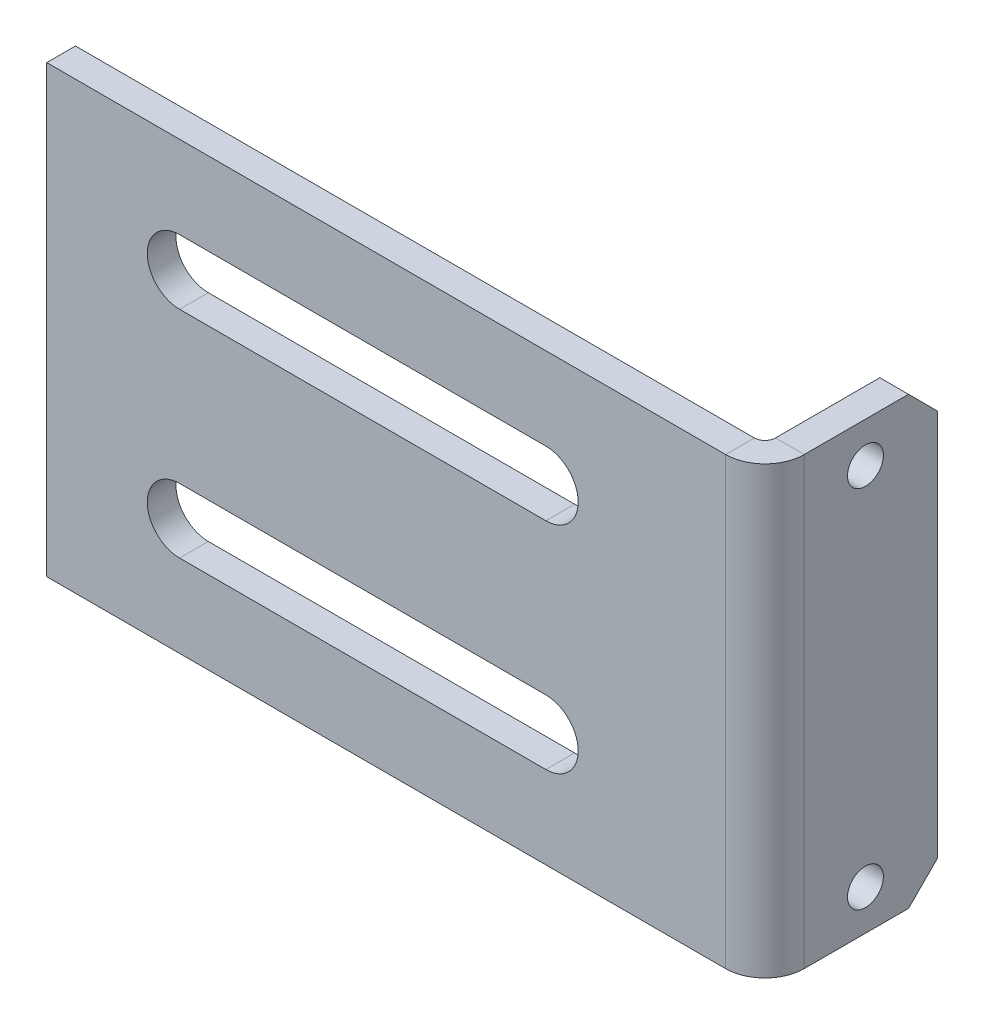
ISO-10303-21;
HEADER;
FILE_DESCRIPTION(('STEP AP214'),'2;1');
FILE_NAME('part.step','',(''),(''),'','','');
FILE_SCHEMA(('AUTOMOTIVE_DESIGN { 1 0 10303 214 1 1 1 1 }'));
ENDSEC;
DATA;
#1=APPLICATION_CONTEXT('core data for automotive mechanical design processes');
#2=APPLICATION_PROTOCOL_DEFINITION('international standard','automotive_design',2000,#1);
#3=PRODUCT_CONTEXT('',#1,'mechanical');
#4=PRODUCT('Part','Part','',(#3));
#5=PRODUCT_RELATED_PRODUCT_CATEGORY('part','',(#4));
#6=PRODUCT_DEFINITION_FORMATION('','',#4);
#7=PRODUCT_DEFINITION_CONTEXT('part definition',#1,'design');
#8=PRODUCT_DEFINITION('design','',#6,#7);
#9=PRODUCT_DEFINITION_SHAPE('','',#8);
#10=(LENGTH_UNIT() NAMED_UNIT(*) SI_UNIT(.MILLI.,.METRE.));
#11=(NAMED_UNIT(*) PLANE_ANGLE_UNIT() SI_UNIT($,.RADIAN.));
#12=(NAMED_UNIT(*) SI_UNIT($,.STERADIAN.) SOLID_ANGLE_UNIT());
#13=UNCERTAINTY_MEASURE_WITH_UNIT(LENGTH_MEASURE(1.E-05),#10,'distance_accuracy_value','');
#14=(GEOMETRIC_REPRESENTATION_CONTEXT(3) GLOBAL_UNCERTAINTY_ASSIGNED_CONTEXT((#13)) GLOBAL_UNIT_ASSIGNED_CONTEXT((#10,
#11,#12)) REPRESENTATION_CONTEXT('',''));
#15=CARTESIAN_POINT('',(0.,0.,0.));
#16=DIRECTION('',(0.,0.,1.));
#17=DIRECTION('',(1.,0.,0.));
#18=AXIS2_PLACEMENT_3D('',#15,#16,#17);
#19=CARTESIAN_POINT('',(0.,-11.4337247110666,-2.));
#20=DIRECTION('',(0.,-1.,0.));
#21=DIRECTION('',(0.,0.,-1.));
#22=AXIS2_PLACEMENT_3D('',#19,#20,#21);
#23=PLANE('',#22);
#24=DIRECTION('',(1.,0.,0.));
#25=VECTOR('',#24,1.);
#26=CARTESIAN_POINT('',(0.,-11.4337247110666,-2.));
#27=LINE('',#26,#25);
#28=CARTESIAN_POINT('',(0.,-11.4337247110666,-2.));
#29=VERTEX_POINT('',#28);
#30=CARTESIAN_POINT('',(47.2634,-11.4337247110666,-2.));
#31=VERTEX_POINT('',#30);
#32=EDGE_CURVE('E266',#29,#31,#27,.T.);
#33=ORIENTED_EDGE('',*,*,#32,.T.);
#34=DIRECTION('',(0.,0.,1.));
#35=VECTOR('',#34,1.);
#36=CARTESIAN_POINT('',(47.2634,-11.4337247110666,-2.));
#37=LINE('',#36,#35);
#38=CARTESIAN_POINT('',(47.2634,-11.4337247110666,0.));
#39=VERTEX_POINT('',#38);
#40=EDGE_CURVE('E247',#31,#39,#37,.T.);
#41=ORIENTED_EDGE('',*,*,#40,.T.);
#42=DIRECTION('',(1.,0.,0.));
#43=VECTOR('',#42,1.);
#44=CARTESIAN_POINT('',(0.,-11.4337247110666,0.));
#45=LINE('',#44,#43);
#46=CARTESIAN_POINT('',(0.,-11.4337247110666,0.));
#47=VERTEX_POINT('',#46);
#48=EDGE_CURVE('E275',#47,#39,#45,.T.);
#49=ORIENTED_EDGE('',*,*,#48,.F.);
#50=DIRECTION('',(0.,0.,1.));
#51=VECTOR('',#50,1.);
#52=CARTESIAN_POINT('',(0.,-11.4337247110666,-2.));
#53=LINE('',#52,#51);
#54=EDGE_CURVE('E272',#29,#47,#53,.T.);
#55=ORIENTED_EDGE('',*,*,#54,.F.);
#56=EDGE_LOOP('',(#33,#41,#49,#55));
#57=FACE_BOUND('',#56,.T.);
#58=ADVANCED_FACE('F16',(#57),#23,.T.);
#59=CARTESIAN_POINT('',(0.,0.,-2.));
#60=DIRECTION('',(0.,0.,-1.));
#61=DIRECTION('',(-1.,0.,0.));
#62=AXIS2_PLACEMENT_3D('',#59,#60,#61);
#63=PLANE('',#62);
#64=CARTESIAN_POINT('',(9.25,-3.43372471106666,-2.));
#65=DIRECTION('',(0.,0.,-1.));
#66=DIRECTION('',(-1.,0.,0.));
#67=AXIS2_PLACEMENT_3D('',#64,#65,#66);
#68=CIRCLE('',#67,2.25);
#69=CARTESIAN_POINT('',(9.25,-5.68372471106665,-2.));
#70=VERTEX_POINT('',#69);
#71=CARTESIAN_POINT('',(9.25,-1.18372471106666,-2.));
#72=VERTEX_POINT('',#71);
#73=EDGE_CURVE('E164',#70,#72,#68,.T.);
#74=ORIENTED_EDGE('',*,*,#73,.F.);
#75=DIRECTION('',(-1.,0.,0.));
#76=VECTOR('',#75,1.);
#77=CARTESIAN_POINT('',(0.,-5.68372471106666,-2.));
#78=LINE('',#77,#76);
#79=CARTESIAN_POINT('',(34.75,-5.68372471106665,-2.));
#80=VERTEX_POINT('',#79);
#81=EDGE_CURVE('E180',#80,#70,#78,.T.);
#82=ORIENTED_EDGE('',*,*,#81,.F.);
#83=CARTESIAN_POINT('',(34.75,-3.43372471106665,-2.));
#84=DIRECTION('',(0.,0.,-1.));
#85=DIRECTION('',(-1.,0.,0.));
#86=AXIS2_PLACEMENT_3D('',#83,#84,#85);
#87=CIRCLE('',#86,2.25);
#88=CARTESIAN_POINT('',(34.75,-1.18372471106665,-2.));
#89=VERTEX_POINT('',#88);
#90=EDGE_CURVE('E185',#89,#80,#87,.T.);
#91=ORIENTED_EDGE('',*,*,#90,.F.);
#92=DIRECTION('',(1.,0.,0.));
#93=VECTOR('',#92,1.);
#94=CARTESIAN_POINT('',(0.,-1.18372471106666,-2.));
#95=LINE('',#94,#93);
#96=EDGE_CURVE('E182',#72,#89,#95,.T.);
#97=ORIENTED_EDGE('',*,*,#96,.F.);
#98=EDGE_LOOP('',(#74,#82,#91,#97));
#99=FACE_BOUND('',#98,.T.);
#100=CARTESIAN_POINT('',(9.25,11.5662752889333,-2.));
#101=DIRECTION('',(0.,0.,-1.));
#102=DIRECTION('',(-1.,0.,0.));
#103=AXIS2_PLACEMENT_3D('',#100,#101,#102);
#104=CIRCLE('',#103,2.25);
#105=CARTESIAN_POINT('',(9.25,9.31627528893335,-2.));
#106=VERTEX_POINT('',#105);
#107=CARTESIAN_POINT('',(9.25,13.8162752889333,-2.));
#108=VERTEX_POINT('',#107);
#109=EDGE_CURVE('E214',#106,#108,#104,.T.);
#110=ORIENTED_EDGE('',*,*,#109,.F.);
#111=DIRECTION('',(-1.,0.,0.));
#112=VECTOR('',#111,1.);
#113=CARTESIAN_POINT('',(0.,9.31627528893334,-2.));
#114=LINE('',#113,#112);
#115=CARTESIAN_POINT('',(34.75,9.31627528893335,-2.));
#116=VERTEX_POINT('',#115);
#117=EDGE_CURVE('E207',#116,#106,#114,.T.);
#118=ORIENTED_EDGE('',*,*,#117,.F.);
#119=CARTESIAN_POINT('',(34.75,11.5662752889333,-2.));
#120=DIRECTION('',(0.,0.,-1.));
#121=DIRECTION('',(-1.,0.,0.));
#122=AXIS2_PLACEMENT_3D('',#119,#120,#121);
#123=CIRCLE('',#122,2.25);
#124=CARTESIAN_POINT('',(34.75,13.8162752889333,-2.));
#125=VERTEX_POINT('',#124);
#126=EDGE_CURVE('E211',#125,#116,#123,.T.);
#127=ORIENTED_EDGE('',*,*,#126,.F.);
#128=DIRECTION('',(1.,0.,0.));
#129=VECTOR('',#128,1.);
#130=CARTESIAN_POINT('',(0.,13.8162752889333,-2.));
#131=LINE('',#130,#129);
#132=EDGE_CURVE('E209',#108,#125,#131,.T.);
#133=ORIENTED_EDGE('',*,*,#132,.F.);
#134=EDGE_LOOP('',(#110,#118,#127,#133));
#135=FACE_BOUND('',#134,.T.);
#136=DIRECTION('',(-1.,0.,0.));
#137=VECTOR('',#136,1.);
#138=CARTESIAN_POINT('',(0.,19.5662752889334,-2.));
#139=LINE('',#138,#137);
#140=CARTESIAN_POINT('',(47.2634,19.5662752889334,-2.));
#141=VERTEX_POINT('',#140);
#142=CARTESIAN_POINT('',(0.,19.5662752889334,-2.));
#143=VERTEX_POINT('',#142);
#144=EDGE_CURVE('E270',#141,#143,#139,.T.);
#145=ORIENTED_EDGE('',*,*,#144,.F.);
#146=DIRECTION('',(0.,-1.,0.));
#147=VECTOR('',#146,1.);
#148=CARTESIAN_POINT('',(47.2634,-11.4337247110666,-2.));
#149=LINE('',#148,#147);
#150=EDGE_CURVE('E253',#31,#141,#149,.F.);
#151=ORIENTED_EDGE('',*,*,#150,.F.);
#152=ORIENTED_EDGE('',*,*,#32,.F.);
#153=DIRECTION('',(0.,-1.,0.));
#154=VECTOR('',#153,1.);
#155=CARTESIAN_POINT('',(0.,-11.4337247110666,-2.));
#156=LINE('',#155,#154);
#157=EDGE_CURVE('E263',#143,#29,#156,.T.);
#158=ORIENTED_EDGE('',*,*,#157,.F.);
#159=EDGE_LOOP('',(#145,#151,#152,#158));
#160=FACE_BOUND('',#159,.T.);
#161=ADVANCED_FACE('F332',(#99,#135,#160),#63,.T.);
#162=CARTESIAN_POINT('',(0.,0.,0.));
#163=DIRECTION('',(0.,0.,-1.));
#164=DIRECTION('',(-1.,0.,0.));
#165=AXIS2_PLACEMENT_3D('',#162,#163,#164);
#166=PLANE('',#165);
#167=CARTESIAN_POINT('',(9.25,-3.43372471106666,0.));
#168=DIRECTION('',(0.,0.,1.));
#169=DIRECTION('',(1.,0.,0.));
#170=AXIS2_PLACEMENT_3D('',#167,#168,#169);
#171=CIRCLE('',#170,2.25);
#172=CARTESIAN_POINT('',(9.25,-1.18372471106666,0.));
#173=VERTEX_POINT('',#172);
#174=CARTESIAN_POINT('',(9.25,-5.68372471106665,0.));
#175=VERTEX_POINT('',#174);
#176=EDGE_CURVE('E156',#173,#175,#171,.T.);
#177=ORIENTED_EDGE('',*,*,#176,.F.);
#178=DIRECTION('',(1.,0.,0.));
#179=VECTOR('',#178,1.);
#180=CARTESIAN_POINT('',(9.25,-1.18372471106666,0.));
#181=LINE('',#180,#179);
#182=CARTESIAN_POINT('',(34.75,-1.18372471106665,0.));
#183=VERTEX_POINT('',#182);
#184=EDGE_CURVE('E145',#173,#183,#181,.T.);
#185=ORIENTED_EDGE('',*,*,#184,.T.);
#186=CARTESIAN_POINT('',(34.75,-3.43372471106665,0.));
#187=DIRECTION('',(0.,0.,1.));
#188=DIRECTION('',(1.,0.,0.));
#189=AXIS2_PLACEMENT_3D('',#186,#187,#188);
#190=CIRCLE('',#189,2.25);
#191=CARTESIAN_POINT('',(34.75,-5.68372471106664,0.));
#192=VERTEX_POINT('',#191);
#193=EDGE_CURVE('E165',#192,#183,#190,.T.);
#194=ORIENTED_EDGE('',*,*,#193,.F.);
#195=DIRECTION('',(1.,0.,0.));
#196=VECTOR('',#195,1.);
#197=CARTESIAN_POINT('',(9.25,-5.68372471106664,0.));
#198=LINE('',#197,#196);
#199=EDGE_CURVE('E157',#175,#192,#198,.T.);
#200=ORIENTED_EDGE('',*,*,#199,.F.);
#201=EDGE_LOOP('',(#177,#185,#194,#200));
#202=FACE_BOUND('',#201,.T.);
#203=CARTESIAN_POINT('',(9.25,11.5662752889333,0.));
#204=DIRECTION('',(0.,0.,1.));
#205=DIRECTION('',(1.,0.,0.));
#206=AXIS2_PLACEMENT_3D('',#203,#204,#205);
#207=CIRCLE('',#206,2.25);
#208=CARTESIAN_POINT('',(9.25,13.8162752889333,0.));
#209=VERTEX_POINT('',#208);
#210=CARTESIAN_POINT('',(9.25,9.31627528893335,0.));
#211=VERTEX_POINT('',#210);
#212=EDGE_CURVE('E192',#209,#211,#207,.T.);
#213=ORIENTED_EDGE('',*,*,#212,.F.);
#214=DIRECTION('',(1.,0.,0.));
#215=VECTOR('',#214,1.);
#216=CARTESIAN_POINT('',(9.25,13.8162752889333,0.));
#217=LINE('',#216,#215);
#218=CARTESIAN_POINT('',(34.75,13.8162752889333,0.));
#219=VERTEX_POINT('',#218);
#220=EDGE_CURVE('E189',#209,#219,#217,.T.);
#221=ORIENTED_EDGE('',*,*,#220,.T.);
#222=CARTESIAN_POINT('',(34.75,11.5662752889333,0.));
#223=DIRECTION('',(0.,0.,1.));
#224=DIRECTION('',(1.,0.,0.));
#225=AXIS2_PLACEMENT_3D('',#222,#223,#224);
#226=CIRCLE('',#225,2.25);
#227=CARTESIAN_POINT('',(34.75,9.31627528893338,0.));
#228=VERTEX_POINT('',#227);
#229=EDGE_CURVE('E200',#228,#219,#226,.T.);
#230=ORIENTED_EDGE('',*,*,#229,.F.);
#231=DIRECTION('',(1.,0.,0.));
#232=VECTOR('',#231,1.);
#233=CARTESIAN_POINT('',(9.25,9.31627528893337,0.));
#234=LINE('',#233,#232);
#235=EDGE_CURVE('E187',#211,#228,#234,.T.);
#236=ORIENTED_EDGE('',*,*,#235,.F.);
#237=EDGE_LOOP('',(#213,#221,#230,#236));
#238=FACE_BOUND('',#237,.T.);
#239=DIRECTION('',(0.,-1.,0.));
#240=VECTOR('',#239,1.);
#241=CARTESIAN_POINT('',(47.2634,-11.4337247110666,0.));
#242=LINE('',#241,#240);
#243=CARTESIAN_POINT('',(47.2634,19.5662752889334,0.));
#244=VERTEX_POINT('',#243);
#245=EDGE_CURVE('E241',#39,#244,#242,.F.);
#246=ORIENTED_EDGE('',*,*,#245,.T.);
#247=DIRECTION('',(-1.,0.,0.));
#248=VECTOR('',#247,1.);
#249=CARTESIAN_POINT('',(0.,19.5662752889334,0.));
#250=LINE('',#249,#248);
#251=CARTESIAN_POINT('',(0.,19.5662752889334,0.));
#252=VERTEX_POINT('',#251);
#253=EDGE_CURVE('E267',#244,#252,#250,.T.);
#254=ORIENTED_EDGE('',*,*,#253,.T.);
#255=DIRECTION('',(0.,-1.,0.));
#256=VECTOR('',#255,1.);
#257=CARTESIAN_POINT('',(0.,-11.4337247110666,0.));
#258=LINE('',#257,#256);
#259=EDGE_CURVE('E261',#252,#47,#258,.T.);
#260=ORIENTED_EDGE('',*,*,#259,.T.);
#261=ORIENTED_EDGE('',*,*,#48,.T.);
#262=EDGE_LOOP('',(#246,#254,#260,#261));
#263=FACE_BOUND('',#262,.T.);
#264=ADVANCED_FACE('F169',(#202,#238,#263),#166,.F.);
#265=CARTESIAN_POINT('',(0.,-11.4337247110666,-2.));
#266=DIRECTION('',(-1.,0.,0.));
#267=DIRECTION('',(0.,0.,1.));
#268=AXIS2_PLACEMENT_3D('',#265,#266,#267);
#269=PLANE('',#268);
#270=ORIENTED_EDGE('',*,*,#259,.F.);
#271=DIRECTION('',(0.,0.,1.));
#272=VECTOR('',#271,1.);
#273=CARTESIAN_POINT('',(0.,19.5662752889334,-2.));
#274=LINE('',#273,#272);
#275=EDGE_CURVE('E279',#143,#252,#274,.T.);
#276=ORIENTED_EDGE('',*,*,#275,.F.);
#277=ORIENTED_EDGE('',*,*,#157,.T.);
#278=ORIENTED_EDGE('',*,*,#54,.T.);
#279=EDGE_LOOP('',(#270,#276,#277,#278));
#280=FACE_BOUND('',#279,.T.);
#281=ADVANCED_FACE('F338',(#280),#269,.T.);
#282=CARTESIAN_POINT('',(0.,19.5662752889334,-2.));
#283=DIRECTION('',(0.,1.,0.));
#284=DIRECTION('',(0.,0.,1.));
#285=AXIS2_PLACEMENT_3D('',#282,#283,#284);
#286=PLANE('',#285);
#287=DIRECTION('',(0.,0.,1.));
#288=VECTOR('',#287,1.);
#289=CARTESIAN_POINT('',(47.2634,19.5662752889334,-2.));
#290=LINE('',#289,#288);
#291=EDGE_CURVE('E258',#141,#244,#290,.T.);
#292=ORIENTED_EDGE('',*,*,#291,.F.);
#293=ORIENTED_EDGE('',*,*,#144,.T.);
#294=ORIENTED_EDGE('',*,*,#275,.T.);
#295=ORIENTED_EDGE('',*,*,#253,.F.);
#296=EDGE_LOOP('',(#292,#293,#294,#295));
#297=FACE_BOUND('',#296,.T.);
#298=ADVANCED_FACE('F342',(#297),#286,.T.);
#299=CARTESIAN_POINT('',(47.2634,19.5662752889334,-2.7366));
#300=DIRECTION('',(0.,1.,0.));
#301=DIRECTION('',(0.,0.,1.));
#302=AXIS2_PLACEMENT_3D('',#299,#300,#301);
#303=PLANE('',#302);
#304=DIRECTION('',(-1.,0.,0.));
#305=VECTOR('',#304,1.);
#306=CARTESIAN_POINT('',(50.,19.5662752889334,-2.7366));
#307=LINE('',#306,#305);
#308=CARTESIAN_POINT('',(48.,19.5662752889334,-2.7366));
#309=VERTEX_POINT('',#308);
#310=CARTESIAN_POINT('',(50.,19.5662752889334,-2.7366));
#311=VERTEX_POINT('',#310);
#312=EDGE_CURVE('E216',#309,#311,#307,.F.);
#313=ORIENTED_EDGE('',*,*,#312,.F.);
#314=CARTESIAN_POINT('',(47.2634,19.5662752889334,-2.7366));
#315=DIRECTION('',(0.,-1.,0.));
#316=DIRECTION('',(0.,0.,-1.));
#317=AXIS2_PLACEMENT_3D('',#314,#315,#316);
#318=CIRCLE('',#317,0.7366);
#319=EDGE_CURVE('E250',#141,#309,#318,.F.);
#320=ORIENTED_EDGE('',*,*,#319,.F.);
#321=ORIENTED_EDGE('',*,*,#291,.T.);
#322=CARTESIAN_POINT('',(47.2634,19.5662752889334,-2.7366));
#323=DIRECTION('',(0.,-1.,0.));
#324=DIRECTION('',(0.,0.,-1.));
#325=AXIS2_PLACEMENT_3D('',#322,#323,#324);
#326=CIRCLE('',#325,2.7366);
#327=EDGE_CURVE('E243',#244,#311,#326,.F.);
#328=ORIENTED_EDGE('',*,*,#327,.T.);
#329=EDGE_LOOP('',(#313,#320,#321,#328));
#330=FACE_BOUND('',#329,.T.);
#331=ADVANCED_FACE('F321',(#330),#303,.T.);
#332=CARTESIAN_POINT('',(47.2634,-11.4337247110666,-2.7366));
#333=DIRECTION('',(0.,1.,0.));
#334=DIRECTION('',(0.,0.,1.));
#335=AXIS2_PLACEMENT_3D('',#332,#333,#334);
#336=PLANE('',#335);
#337=CARTESIAN_POINT('',(47.2634,-11.4337247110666,-2.7366));
#338=DIRECTION('',(0.,-1.,0.));
#339=DIRECTION('',(0.,0.,-1.));
#340=AXIS2_PLACEMENT_3D('',#337,#338,#339);
#341=CIRCLE('',#340,0.7366);
#342=CARTESIAN_POINT('',(48.,-11.4337247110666,-2.7366));
#343=VERTEX_POINT('',#342);
#344=EDGE_CURVE('E219',#343,#31,#341,.T.);
#345=ORIENTED_EDGE('',*,*,#344,.F.);
#346=DIRECTION('',(-1.,0.,0.));
#347=VECTOR('',#346,1.);
#348=CARTESIAN_POINT('',(48.,-11.4337247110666,-2.7366));
#349=LINE('',#348,#347);
#350=CARTESIAN_POINT('',(50.,-11.4337247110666,-2.7366));
#351=VERTEX_POINT('',#350);
#352=EDGE_CURVE('E234',#343,#351,#349,.F.);
#353=ORIENTED_EDGE('',*,*,#352,.T.);
#354=CARTESIAN_POINT('',(47.2634,-11.4337247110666,-2.7366));
#355=DIRECTION('',(0.,-1.,0.));
#356=DIRECTION('',(0.,0.,-1.));
#357=AXIS2_PLACEMENT_3D('',#354,#355,#356);
#358=CIRCLE('',#357,2.7366);
#359=EDGE_CURVE('E244',#351,#39,#358,.T.);
#360=ORIENTED_EDGE('',*,*,#359,.T.);
#361=ORIENTED_EDGE('',*,*,#40,.F.);
#362=EDGE_LOOP('',(#345,#353,#360,#361));
#363=FACE_BOUND('',#362,.T.);
#364=ADVANCED_FACE('F313',(#363),#336,.F.);
#365=CARTESIAN_POINT('',(47.2634,-11.4337247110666,-2.7366));
#366=DIRECTION('',(0.,-1.,0.));
#367=DIRECTION('',(1.,0.,0.));
#368=AXIS2_PLACEMENT_3D('',#365,#366,#367);
#369=CYLINDRICAL_SURFACE('',#368,2.7366);
#370=ORIENTED_EDGE('',*,*,#245,.F.);
#371=ORIENTED_EDGE('',*,*,#359,.F.);
#372=DIRECTION('',(0.,-1.,0.));
#373=VECTOR('',#372,1.);
#374=CARTESIAN_POINT('',(50.,19.5662752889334,-2.7366));
#375=LINE('',#374,#373);
#376=EDGE_CURVE('E231',#351,#311,#375,.F.);
#377=ORIENTED_EDGE('',*,*,#376,.T.);
#378=ORIENTED_EDGE('',*,*,#327,.F.);
#379=EDGE_LOOP('',(#370,#371,#377,#378));
#380=FACE_BOUND('',#379,.T.);
#381=ADVANCED_FACE('F318',(#380),#369,.T.);
#382=CARTESIAN_POINT('',(47.2634,-11.4337247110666,-2.7366));
#383=DIRECTION('',(0.,-1.,0.));
#384=DIRECTION('',(1.,0.,0.));
#385=AXIS2_PLACEMENT_3D('',#382,#383,#384);
#386=CYLINDRICAL_SURFACE('',#385,0.7366);
#387=ORIENTED_EDGE('',*,*,#150,.T.);
#388=ORIENTED_EDGE('',*,*,#319,.T.);
#389=DIRECTION('',(0.,-1.,0.));
#390=VECTOR('',#389,1.);
#391=CARTESIAN_POINT('',(48.,19.5662752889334,-2.7366));
#392=LINE('',#391,#390);
#393=EDGE_CURVE('E237',#309,#343,#392,.T.);
#394=ORIENTED_EDGE('',*,*,#393,.T.);
#395=ORIENTED_EDGE('',*,*,#344,.T.);
#396=EDGE_LOOP('',(#387,#388,#394,#395));
#397=FACE_BOUND('',#396,.T.);
#398=ADVANCED_FACE('F328',(#397),#386,.F.);
#399=CARTESIAN_POINT('',(50.,-11.4337247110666,-12.));
#400=DIRECTION('',(0.,1.,0.));
#401=DIRECTION('',(0.,0.,1.));
#402=AXIS2_PLACEMENT_3D('',#399,#400,#401);
#403=PLANE('',#402);
#404=DIRECTION('',(0.,0.,1.));
#405=VECTOR('',#404,1.);
#406=CARTESIAN_POINT('',(48.,-11.4337247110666,-12.));
#407=LINE('',#406,#405);
#408=CARTESIAN_POINT('',(48.,-11.4337247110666,-10.));
#409=VERTEX_POINT('',#408);
#410=EDGE_CURVE('E229',#343,#409,#407,.F.);
#411=ORIENTED_EDGE('',*,*,#410,.T.);
#412=DIRECTION('',(1.,0.,0.));
#413=VECTOR('',#412,1.);
#414=CARTESIAN_POINT('',(50.,-11.4337247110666,-10.));
#415=LINE('',#414,#413);
#416=CARTESIAN_POINT('',(50.,-11.4337247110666,-10.));
#417=VERTEX_POINT('',#416);
#418=EDGE_CURVE('E40',#409,#417,#415,.T.);
#419=ORIENTED_EDGE('',*,*,#418,.T.);
#420=DIRECTION('',(0.,0.,-1.));
#421=VECTOR('',#420,1.);
#422=CARTESIAN_POINT('',(50.,-11.4337247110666,1.78471875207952E-13));
#423=LINE('',#422,#421);
#424=EDGE_CURVE('E222',#351,#417,#423,.T.);
#425=ORIENTED_EDGE('',*,*,#424,.F.);
#426=ORIENTED_EDGE('',*,*,#352,.F.);
#427=EDGE_LOOP('',(#411,#419,#425,#426));
#428=FACE_BOUND('',#427,.T.);
#429=ADVANCED_FACE('F310',(#428),#403,.F.);
#430=CARTESIAN_POINT('',(50.,19.5662752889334,-2.));
#431=DIRECTION('',(0.,-1.,0.));
#432=DIRECTION('',(0.,0.,-1.));
#433=AXIS2_PLACEMENT_3D('',#430,#431,#432);
#434=PLANE('',#433);
#435=DIRECTION('',(0.,0.,1.));
#436=VECTOR('',#435,1.);
#437=CARTESIAN_POINT('',(50.,19.5662752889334,1.80455310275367E-13));
#438=LINE('',#437,#436);
#439=CARTESIAN_POINT('',(50.,19.5662752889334,-10.));
#440=VERTEX_POINT('',#439);
#441=EDGE_CURVE('E217',#440,#311,#438,.T.);
#442=ORIENTED_EDGE('',*,*,#441,.F.);
#443=DIRECTION('',(-1.,0.,0.));
#444=VECTOR('',#443,1.);
#445=CARTESIAN_POINT('',(50.,19.5662752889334,-10.));
#446=LINE('',#445,#444);
#447=CARTESIAN_POINT('',(48.,19.5662752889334,-10.));
#448=VERTEX_POINT('',#447);
#449=EDGE_CURVE('E11',#440,#448,#446,.T.);
#450=ORIENTED_EDGE('',*,*,#449,.T.);
#451=DIRECTION('',(0.,0.,-1.));
#452=VECTOR('',#451,1.);
#453=CARTESIAN_POINT('',(48.,19.5662752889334,-2.));
#454=LINE('',#453,#452);
#455=EDGE_CURVE('E224',#448,#309,#454,.F.);
#456=ORIENTED_EDGE('',*,*,#455,.T.);
#457=ORIENTED_EDGE('',*,*,#312,.T.);
#458=EDGE_LOOP('',(#442,#450,#456,#457));
#459=FACE_BOUND('',#458,.T.);
#460=ADVANCED_FACE('F324',(#459),#434,.F.);
#461=CARTESIAN_POINT('',(50.,0.,1.80455310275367E-13));
#462=DIRECTION('',(-1.,0.,0.));
#463=DIRECTION('',(0.,0.,1.));
#464=AXIS2_PLACEMENT_3D('',#461,#462,#463);
#465=PLANE('',#464);
#466=CARTESIAN_POINT('',(50.,16.7662752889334,-7.));
#467=DIRECTION('',(1.,0.,0.));
#468=DIRECTION('',(0.,0.,-1.));
#469=AXIS2_PLACEMENT_3D('',#466,#467,#468);
#470=CIRCLE('',#469,1.25);
#471=CARTESIAN_POINT('',(50.,16.7662752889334,-8.25));
#472=VERTEX_POINT('',#471);
#473=EDGE_CURVE('E595',#472,#472,#470,.T.);
#474=ORIENTED_EDGE('',*,*,#473,.F.);
#475=EDGE_LOOP('',(#474));
#476=FACE_BOUND('',#475,.T.);
#477=CARTESIAN_POINT('',(50.,-8.63372471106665,-7.));
#478=DIRECTION('',(1.,0.,0.));
#479=DIRECTION('',(0.,0.,-1.));
#480=AXIS2_PLACEMENT_3D('',#477,#478,#479);
#481=CIRCLE('',#480,1.25);
#482=CARTESIAN_POINT('',(50.,-8.63372471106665,-8.25));
#483=VERTEX_POINT('',#482);
#484=EDGE_CURVE('E597',#483,#483,#481,.T.);
#485=ORIENTED_EDGE('',*,*,#484,.F.);
#486=EDGE_LOOP('',(#485));
#487=FACE_BOUND('',#486,.T.);
#488=ORIENTED_EDGE('',*,*,#424,.T.);
#489=DIRECTION('',(0.,-0.707106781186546,0.707106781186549));
#490=VECTOR('',#489,1.);
#491=CARTESIAN_POINT('',(50.,-9.43372471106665,-12.));
#492=LINE('',#491,#490);
#493=CARTESIAN_POINT('',(50.,-9.43372471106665,-12.));
#494=VERTEX_POINT('',#493);
#495=EDGE_CURVE('E25',#417,#494,#492,.F.);
#496=ORIENTED_EDGE('',*,*,#495,.T.);
#497=DIRECTION('',(0.,1.,0.));
#498=VECTOR('',#497,1.);
#499=CARTESIAN_POINT('',(50.,0.,-12.));
#500=LINE('',#499,#498);
#501=CARTESIAN_POINT('',(50.,17.5662752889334,-12.));
#502=VERTEX_POINT('',#501);
#503=EDGE_CURVE('E220',#494,#502,#500,.T.);
#504=ORIENTED_EDGE('',*,*,#503,.T.);
#505=DIRECTION('',(0.,-0.707106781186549,-0.707106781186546));
#506=VECTOR('',#505,1.);
#507=CARTESIAN_POINT('',(50.,19.5662752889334,-10.));
#508=LINE('',#507,#506);
#509=EDGE_CURVE('E32',#502,#440,#508,.F.);
#510=ORIENTED_EDGE('',*,*,#509,.T.);
#511=ORIENTED_EDGE('',*,*,#441,.T.);
#512=ORIENTED_EDGE('',*,*,#376,.F.);
#513=EDGE_LOOP('',(#488,#496,#504,#510,#511,#512));
#514=FACE_BOUND('',#513,.T.);
#515=ADVANCED_FACE('F296',(#476,#487,#514),#465,.F.);
#516=CARTESIAN_POINT('',(48.,0.,1.7347234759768E-13));
#517=DIRECTION('',(-1.,0.,0.));
#518=DIRECTION('',(0.,0.,1.));
#519=AXIS2_PLACEMENT_3D('',#516,#517,#518);
#520=PLANE('',#519);
#521=CARTESIAN_POINT('',(48.,16.7662752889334,-7.));
#522=DIRECTION('',(-1.,0.,0.));
#523=DIRECTION('',(0.,0.,1.));
#524=AXIS2_PLACEMENT_3D('',#521,#522,#523);
#525=CIRCLE('',#524,1.25);
#526=CARTESIAN_POINT('',(48.,16.7662752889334,-5.75));
#527=VERTEX_POINT('',#526);
#528=EDGE_CURVE('E20',#527,#527,#525,.T.);
#529=ORIENTED_EDGE('',*,*,#528,.F.);
#530=EDGE_LOOP('',(#529));
#531=FACE_BOUND('',#530,.T.);
#532=CARTESIAN_POINT('',(48.,-8.63372471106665,-7.));
#533=DIRECTION('',(-1.,0.,0.));
#534=DIRECTION('',(0.,0.,1.));
#535=AXIS2_PLACEMENT_3D('',#532,#533,#534);
#536=CIRCLE('',#535,1.25);
#537=CARTESIAN_POINT('',(48.,-8.63372471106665,-5.75));
#538=VERTEX_POINT('',#537);
#539=EDGE_CURVE('E601',#538,#538,#536,.T.);
#540=ORIENTED_EDGE('',*,*,#539,.F.);
#541=EDGE_LOOP('',(#540));
#542=FACE_BOUND('',#541,.T.);
#543=DIRECTION('',(0.,-1.,0.));
#544=VECTOR('',#543,1.);
#545=CARTESIAN_POINT('',(48.,19.5662752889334,-12.));
#546=LINE('',#545,#544);
#547=CARTESIAN_POINT('',(48.,-9.43372471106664,-12.));
#548=VERTEX_POINT('',#547);
#549=CARTESIAN_POINT('',(48.,17.5662752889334,-12.));
#550=VERTEX_POINT('',#549);
#551=EDGE_CURVE('E226',#548,#550,#546,.F.);
#552=ORIENTED_EDGE('',*,*,#551,.F.);
#553=DIRECTION('',(0.,0.707106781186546,-0.707106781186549));
#554=VECTOR('',#553,1.);
#555=CARTESIAN_POINT('',(48.,-10.7168623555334,-10.7168623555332));
#556=LINE('',#555,#554);
#557=EDGE_CURVE('E290',#548,#409,#556,.F.);
#558=ORIENTED_EDGE('',*,*,#557,.T.);
#559=ORIENTED_EDGE('',*,*,#410,.F.);
#560=ORIENTED_EDGE('',*,*,#393,.F.);
#561=ORIENTED_EDGE('',*,*,#455,.F.);
#562=DIRECTION('',(0.,0.707106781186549,0.707106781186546));
#563=VECTOR('',#562,1.);
#564=CARTESIAN_POINT('',(48.,14.7831376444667,-14.7831376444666));
#565=LINE('',#564,#563);
#566=EDGE_CURVE('E288',#448,#550,#565,.F.);
#567=ORIENTED_EDGE('',*,*,#566,.T.);
#568=EDGE_LOOP('',(#552,#558,#559,#560,#561,#567));
#569=FACE_BOUND('',#568,.T.);
#570=ADVANCED_FACE('F307',(#531,#542,#569),#520,.T.);
#571=CARTESIAN_POINT('',(50.,19.5662752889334,-12.));
#572=DIRECTION('',(0.,0.,1.));
#573=DIRECTION('',(1.,0.,0.));
#574=AXIS2_PLACEMENT_3D('',#571,#572,#573);
#575=PLANE('',#574);
#576=ORIENTED_EDGE('',*,*,#503,.F.);
#577=DIRECTION('',(-1.,0.,0.));
#578=VECTOR('',#577,1.);
#579=CARTESIAN_POINT('',(50.,-9.43372471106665,-12.));
#580=LINE('',#579,#578);
#581=EDGE_CURVE('E285',#494,#548,#580,.T.);
#582=ORIENTED_EDGE('',*,*,#581,.T.);
#583=ORIENTED_EDGE('',*,*,#551,.T.);
#584=DIRECTION('',(1.,0.,0.));
#585=VECTOR('',#584,1.);
#586=CARTESIAN_POINT('',(50.,17.5662752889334,-12.));
#587=LINE('',#586,#585);
#588=EDGE_CURVE('E282',#550,#502,#587,.T.);
#589=ORIENTED_EDGE('',*,*,#588,.T.);
#590=EDGE_LOOP('',(#576,#582,#583,#589));
#591=FACE_BOUND('',#590,.T.);
#592=ADVANCED_FACE('F301',(#591),#575,.F.);
#593=CARTESIAN_POINT('',(34.75,11.5662752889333,0.));
#594=DIRECTION('',(0.,0.,1.));
#595=DIRECTION('',(1.,0.,0.));
#596=AXIS2_PLACEMENT_3D('',#593,#594,#595);
#597=CYLINDRICAL_SURFACE('',#596,2.25);
#598=ORIENTED_EDGE('',*,*,#126,.T.);
#599=DIRECTION('',(0.,0.,1.));
#600=VECTOR('',#599,1.);
#601=CARTESIAN_POINT('',(34.75,9.31627528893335,0.));
#602=LINE('',#601,#600);
#603=EDGE_CURVE('E205',#228,#116,#602,.F.);
#604=ORIENTED_EDGE('',*,*,#603,.F.);
#605=ORIENTED_EDGE('',*,*,#229,.T.);
#606=DIRECTION('',(0.,0.,1.));
#607=VECTOR('',#606,1.);
#608=CARTESIAN_POINT('',(34.75,13.8162752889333,0.));
#609=LINE('',#608,#607);
#610=EDGE_CURVE('E203',#125,#219,#609,.T.);
#611=ORIENTED_EDGE('',*,*,#610,.F.);
#612=EDGE_LOOP('',(#598,#604,#605,#611));
#613=FACE_BOUND('',#612,.T.);
#614=ADVANCED_FACE('F397',(#613),#597,.F.);
#615=CARTESIAN_POINT('',(9.25,11.5662752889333,0.));
#616=DIRECTION('',(0.,0.,1.));
#617=DIRECTION('',(1.,0.,0.));
#618=AXIS2_PLACEMENT_3D('',#615,#616,#617);
#619=CYLINDRICAL_SURFACE('',#618,2.25);
#620=ORIENTED_EDGE('',*,*,#109,.T.);
#621=DIRECTION('',(0.,0.,1.));
#622=VECTOR('',#621,1.);
#623=CARTESIAN_POINT('',(9.25,13.8162752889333,0.));
#624=LINE('',#623,#622);
#625=EDGE_CURVE('E197',#209,#108,#624,.F.);
#626=ORIENTED_EDGE('',*,*,#625,.F.);
#627=ORIENTED_EDGE('',*,*,#212,.T.);
#628=DIRECTION('',(0.,0.,1.));
#629=VECTOR('',#628,1.);
#630=CARTESIAN_POINT('',(9.25,9.31627528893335,0.));
#631=LINE('',#630,#629);
#632=EDGE_CURVE('E194',#106,#211,#631,.T.);
#633=ORIENTED_EDGE('',*,*,#632,.F.);
#634=EDGE_LOOP('',(#620,#626,#627,#633));
#635=FACE_BOUND('',#634,.T.);
#636=ADVANCED_FACE('F393',(#635),#619,.F.);
#637=CARTESIAN_POINT('',(9.25,13.8162752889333,0.));
#638=DIRECTION('',(0.,1.,0.));
#639=DIRECTION('',(-1.,0.,0.));
#640=AXIS2_PLACEMENT_3D('',#637,#638,#639);
#641=PLANE('',#640);
#642=ORIENTED_EDGE('',*,*,#132,.T.);
#643=ORIENTED_EDGE('',*,*,#610,.T.);
#644=ORIENTED_EDGE('',*,*,#220,.F.);
#645=ORIENTED_EDGE('',*,*,#625,.T.);
#646=EDGE_LOOP('',(#642,#643,#644,#645));
#647=FACE_BOUND('',#646,.T.);
#648=ADVANCED_FACE('F389',(#647),#641,.F.);
#649=CARTESIAN_POINT('',(9.25,9.31627528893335,0.));
#650=DIRECTION('',(0.,-1.,0.));
#651=DIRECTION('',(1.,0.,0.));
#652=AXIS2_PLACEMENT_3D('',#649,#650,#651);
#653=PLANE('',#652);
#654=ORIENTED_EDGE('',*,*,#117,.T.);
#655=ORIENTED_EDGE('',*,*,#632,.T.);
#656=ORIENTED_EDGE('',*,*,#235,.T.);
#657=ORIENTED_EDGE('',*,*,#603,.T.);
#658=EDGE_LOOP('',(#654,#655,#656,#657));
#659=FACE_BOUND('',#658,.T.);
#660=ADVANCED_FACE('F385',(#659),#653,.F.);
#661=CARTESIAN_POINT('',(34.75,-3.43372471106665,0.));
#662=DIRECTION('',(0.,0.,1.));
#663=DIRECTION('',(1.,0.,0.));
#664=AXIS2_PLACEMENT_3D('',#661,#662,#663);
#665=CYLINDRICAL_SURFACE('',#664,2.25);
#666=ORIENTED_EDGE('',*,*,#90,.T.);
#667=DIRECTION('',(0.,0.,1.));
#668=VECTOR('',#667,1.);
#669=CARTESIAN_POINT('',(34.75,-5.68372471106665,0.));
#670=LINE('',#669,#668);
#671=EDGE_CURVE('E177',#192,#80,#670,.F.);
#672=ORIENTED_EDGE('',*,*,#671,.F.);
#673=ORIENTED_EDGE('',*,*,#193,.T.);
#674=DIRECTION('',(0.,0.,1.));
#675=VECTOR('',#674,1.);
#676=CARTESIAN_POINT('',(34.75,-1.18372471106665,0.));
#677=LINE('',#676,#675);
#678=EDGE_CURVE('E151',#89,#183,#677,.T.);
#679=ORIENTED_EDGE('',*,*,#678,.F.);
#680=EDGE_LOOP('',(#666,#672,#673,#679));
#681=FACE_BOUND('',#680,.T.);
#682=ADVANCED_FACE('F382',(#681),#665,.F.);
#683=CARTESIAN_POINT('',(9.25,-3.43372471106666,0.));
#684=DIRECTION('',(0.,0.,1.));
#685=DIRECTION('',(1.,0.,0.));
#686=AXIS2_PLACEMENT_3D('',#683,#684,#685);
#687=CYLINDRICAL_SURFACE('',#686,2.25);
#688=ORIENTED_EDGE('',*,*,#73,.T.);
#689=DIRECTION('',(0.,0.,1.));
#690=VECTOR('',#689,1.);
#691=CARTESIAN_POINT('',(9.25,-1.18372471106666,0.));
#692=LINE('',#691,#690);
#693=EDGE_CURVE('E149',#173,#72,#692,.F.);
#694=ORIENTED_EDGE('',*,*,#693,.F.);
#695=ORIENTED_EDGE('',*,*,#176,.T.);
#696=DIRECTION('',(0.,0.,1.));
#697=VECTOR('',#696,1.);
#698=CARTESIAN_POINT('',(9.25,-5.68372471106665,0.));
#699=LINE('',#698,#697);
#700=EDGE_CURVE('E166',#70,#175,#699,.T.);
#701=ORIENTED_EDGE('',*,*,#700,.F.);
#702=EDGE_LOOP('',(#688,#694,#695,#701));
#703=FACE_BOUND('',#702,.T.);
#704=ADVANCED_FACE('F160',(#703),#687,.F.);
#705=CARTESIAN_POINT('',(9.25,-1.18372471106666,0.));
#706=DIRECTION('',(0.,1.,0.));
#707=DIRECTION('',(-1.,0.,0.));
#708=AXIS2_PLACEMENT_3D('',#705,#706,#707);
#709=PLANE('',#708);
#710=ORIENTED_EDGE('',*,*,#96,.T.);
#711=ORIENTED_EDGE('',*,*,#678,.T.);
#712=ORIENTED_EDGE('',*,*,#184,.F.);
#713=ORIENTED_EDGE('',*,*,#693,.T.);
#714=EDGE_LOOP('',(#710,#711,#712,#713));
#715=FACE_BOUND('',#714,.T.);
#716=ADVANCED_FACE('F148',(#715),#709,.F.);
#717=CARTESIAN_POINT('',(9.25,-5.68372471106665,0.));
#718=DIRECTION('',(0.,-1.,0.));
#719=DIRECTION('',(1.,0.,0.));
#720=AXIS2_PLACEMENT_3D('',#717,#718,#719);
#721=PLANE('',#720);
#722=ORIENTED_EDGE('',*,*,#81,.T.);
#723=ORIENTED_EDGE('',*,*,#700,.T.);
#724=ORIENTED_EDGE('',*,*,#199,.T.);
#725=ORIENTED_EDGE('',*,*,#671,.T.);
#726=EDGE_LOOP('',(#722,#723,#724,#725));
#727=FACE_BOUND('',#726,.T.);
#728=ADVANCED_FACE('F362',(#727),#721,.F.);
#729=CARTESIAN_POINT('',(50.,-9.43372471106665,-12.));
#730=DIRECTION('',(0.,0.707106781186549,0.707106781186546));
#731=DIRECTION('',(-1.,0.,0.));
#732=AXIS2_PLACEMENT_3D('',#729,#730,#731);
#733=PLANE('',#732);
#734=ORIENTED_EDGE('',*,*,#495,.F.);
#735=ORIENTED_EDGE('',*,*,#418,.F.);
#736=ORIENTED_EDGE('',*,*,#557,.F.);
#737=ORIENTED_EDGE('',*,*,#581,.F.);
#738=EDGE_LOOP('',(#734,#735,#736,#737));
#739=FACE_BOUND('',#738,.T.);
#740=ADVANCED_FACE('F304',(#739),#733,.F.);
#741=CARTESIAN_POINT('',(50.,19.5662752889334,-10.));
#742=DIRECTION('',(0.,-0.707106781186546,0.707106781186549));
#743=DIRECTION('',(-1.,0.,0.));
#744=AXIS2_PLACEMENT_3D('',#741,#742,#743);
#745=PLANE('',#744);
#746=ORIENTED_EDGE('',*,*,#509,.F.);
#747=ORIENTED_EDGE('',*,*,#588,.F.);
#748=ORIENTED_EDGE('',*,*,#566,.F.);
#749=ORIENTED_EDGE('',*,*,#449,.F.);
#750=EDGE_LOOP('',(#746,#747,#748,#749));
#751=FACE_BOUND('',#750,.T.);
#752=ADVANCED_FACE('F18',(#751),#745,.F.);
#753=CARTESIAN_POINT('',(50.,-8.63372471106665,-7.));
#754=DIRECTION('',(1.,0.,0.));
#755=DIRECTION('',(0.,0.,-1.));
#756=AXIS2_PLACEMENT_3D('',#753,#754,#755);
#757=CYLINDRICAL_SURFACE('',#756,1.25);
#758=ORIENTED_EDGE('',*,*,#539,.T.);
#759=EDGE_LOOP('',(#758));
#760=FACE_BOUND('',#759,.T.);
#761=ORIENTED_EDGE('',*,*,#484,.T.);
#762=EDGE_LOOP('',(#761));
#763=FACE_BOUND('',#762,.T.);
#764=ADVANCED_FACE('F368',(#760,#763),#757,.F.);
#765=CARTESIAN_POINT('',(50.,16.7662752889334,-7.));
#766=DIRECTION('',(1.,0.,0.));
#767=DIRECTION('',(0.,0.,-1.));
#768=AXIS2_PLACEMENT_3D('',#765,#766,#767);
#769=CYLINDRICAL_SURFACE('',#768,1.25);
#770=ORIENTED_EDGE('',*,*,#528,.T.);
#771=EDGE_LOOP('',(#770));
#772=FACE_BOUND('',#771,.T.);
#773=ORIENTED_EDGE('',*,*,#473,.T.);
#774=EDGE_LOOP('',(#773));
#775=FACE_BOUND('',#774,.T.);
#776=ADVANCED_FACE('F528',(#772,#775),#769,.F.);
#777=CLOSED_SHELL('',(#58,#161,#264,#281,#298,#331,#364,#381,#398,#429,#460,#515,#570,#592,#614,
#636,#648,#660,#682,#704,#716,#728,#740,#752,#764,#776));
#778=MANIFOLD_SOLID_BREP('B1',#777);
#779=ADVANCED_BREP_SHAPE_REPRESENTATION('',(#18,#778),#14);
#780=SHAPE_DEFINITION_REPRESENTATION(#9,#779);
ENDSEC;
END-ISO-10303-21;
